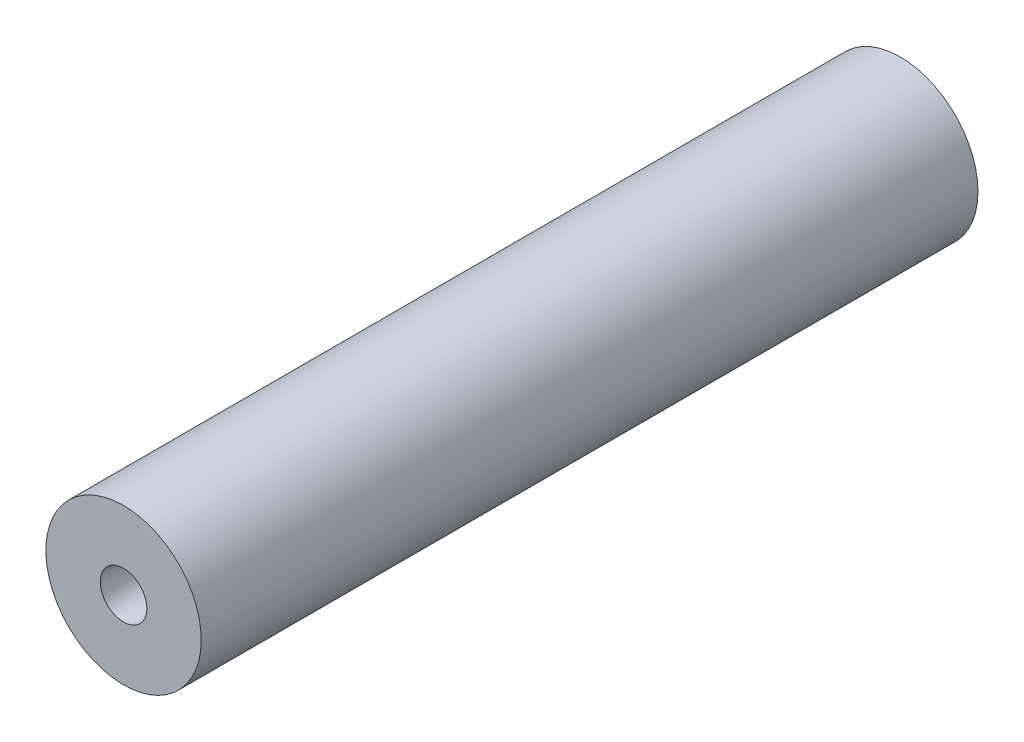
ISO-10303-21;
HEADER;
FILE_DESCRIPTION(('STEP AP214'),'2;1');
FILE_NAME('part.step','',(''),(''),'','','');
FILE_SCHEMA(('AUTOMOTIVE_DESIGN { 1 0 10303 214 1 1 1 1 }'));
ENDSEC;
DATA;
#1=APPLICATION_CONTEXT('core data for automotive mechanical design processes');
#2=APPLICATION_PROTOCOL_DEFINITION('international standard','automotive_design',2000,#1);
#3=PRODUCT_CONTEXT('',#1,'mechanical');
#4=PRODUCT('Part','Part','',(#3));
#5=PRODUCT_RELATED_PRODUCT_CATEGORY('part','',(#4));
#6=PRODUCT_DEFINITION_FORMATION('','',#4);
#7=PRODUCT_DEFINITION_CONTEXT('part definition',#1,'design');
#8=PRODUCT_DEFINITION('design','',#6,#7);
#9=PRODUCT_DEFINITION_SHAPE('','',#8);
#10=(LENGTH_UNIT() NAMED_UNIT(*) SI_UNIT(.MILLI.,.METRE.));
#11=(NAMED_UNIT(*) PLANE_ANGLE_UNIT() SI_UNIT($,.RADIAN.));
#12=(NAMED_UNIT(*) SI_UNIT($,.STERADIAN.) SOLID_ANGLE_UNIT());
#13=UNCERTAINTY_MEASURE_WITH_UNIT(LENGTH_MEASURE(1.E-05),#10,'distance_accuracy_value','');
#14=(GEOMETRIC_REPRESENTATION_CONTEXT(3) GLOBAL_UNCERTAINTY_ASSIGNED_CONTEXT((#13)) GLOBAL_UNIT_ASSIGNED_CONTEXT((#10,
#11,#12)) REPRESENTATION_CONTEXT('',''));
#15=CARTESIAN_POINT('',(0.,0.,0.));
#16=DIRECTION('',(0.,0.,1.));
#17=DIRECTION('',(1.,0.,0.));
#18=AXIS2_PLACEMENT_3D('',#15,#16,#17);
#19=CARTESIAN_POINT('',(0.,0.,100.));
#20=DIRECTION('',(0.,0.,1.));
#21=DIRECTION('',(1.,0.,0.));
#22=AXIS2_PLACEMENT_3D('',#19,#20,#21);
#23=PLANE('',#22);
#24=CARTESIAN_POINT('',(0.,0.,100.));
#25=DIRECTION('',(0.,0.,1.));
#26=DIRECTION('',(1.,0.,0.));
#27=AXIS2_PLACEMENT_3D('',#24,#25,#26);
#28=CIRCLE('',#27,10.);
#29=CARTESIAN_POINT('',(10.,0.,100.));
#30=VERTEX_POINT('',#29);
#31=EDGE_CURVE('E10',#30,#30,#28,.T.);
#32=ORIENTED_EDGE('',*,*,#31,.T.);
#33=EDGE_LOOP('',(#32));
#34=FACE_BOUND('',#33,.T.);
#35=CARTESIAN_POINT('',(0.,0.,100.));
#36=DIRECTION('',(0.,0.,1.));
#37=DIRECTION('',(1.,0.,0.));
#38=AXIS2_PLACEMENT_3D('',#35,#36,#37);
#39=CIRCLE('',#38,3.);
#40=CARTESIAN_POINT('',(3.,0.,100.));
#41=VERTEX_POINT('',#40);
#42=EDGE_CURVE('E56',#41,#41,#39,.T.);
#43=ORIENTED_EDGE('',*,*,#42,.F.);
#44=EDGE_LOOP('',(#43));
#45=FACE_BOUND('',#44,.T.);
#46=ADVANCED_FACE('F43',(#34,#45),#23,.T.);
#47=CARTESIAN_POINT('',(0.,0.,0.));
#48=DIRECTION('',(0.,0.,1.));
#49=DIRECTION('',(1.,0.,0.));
#50=AXIS2_PLACEMENT_3D('',#47,#48,#49);
#51=PLANE('',#50);
#52=CARTESIAN_POINT('',(0.,0.,0.));
#53=DIRECTION('',(0.,0.,1.));
#54=DIRECTION('',(1.,0.,0.));
#55=AXIS2_PLACEMENT_3D('',#52,#53,#54);
#56=CIRCLE('',#55,10.);
#57=CARTESIAN_POINT('',(10.,0.,0.));
#58=VERTEX_POINT('',#57);
#59=EDGE_CURVE('E47',#58,#58,#56,.T.);
#60=ORIENTED_EDGE('',*,*,#59,.F.);
#61=EDGE_LOOP('',(#60));
#62=FACE_BOUND('',#61,.T.);
#63=CARTESIAN_POINT('',(0.,0.,0.));
#64=DIRECTION('',(0.,0.,1.));
#65=DIRECTION('',(1.,0.,0.));
#66=AXIS2_PLACEMENT_3D('',#63,#64,#65);
#67=CIRCLE('',#66,3.);
#68=CARTESIAN_POINT('',(3.,0.,0.));
#69=VERTEX_POINT('',#68);
#70=EDGE_CURVE('E58',#69,#69,#67,.T.);
#71=ORIENTED_EDGE('',*,*,#70,.T.);
#72=EDGE_LOOP('',(#71));
#73=FACE_BOUND('',#72,.T.);
#74=ADVANCED_FACE('F70',(#62,#73),#51,.F.);
#75=CARTESIAN_POINT('',(0.,0.,100.));
#76=DIRECTION('',(0.,0.,-1.));
#77=DIRECTION('',(-1.,0.,0.));
#78=AXIS2_PLACEMENT_3D('',#75,#76,#77);
#79=CYLINDRICAL_SURFACE('',#78,10.);
#80=ORIENTED_EDGE('',*,*,#31,.F.);
#81=EDGE_LOOP('',(#80));
#82=FACE_BOUND('',#81,.T.);
#83=ORIENTED_EDGE('',*,*,#59,.T.);
#84=EDGE_LOOP('',(#83));
#85=FACE_BOUND('',#84,.T.);
#86=ADVANCED_FACE('F45',(#82,#85),#79,.T.);
#87=CARTESIAN_POINT('',(0.,0.,100.));
#88=DIRECTION('',(0.,0.,-1.));
#89=DIRECTION('',(-1.,0.,0.));
#90=AXIS2_PLACEMENT_3D('',#87,#88,#89);
#91=CYLINDRICAL_SURFACE('',#90,3.);
#92=ORIENTED_EDGE('',*,*,#42,.T.);
#93=EDGE_LOOP('',(#92));
#94=FACE_BOUND('',#93,.T.);
#95=ORIENTED_EDGE('',*,*,#70,.F.);
#96=EDGE_LOOP('',(#95));
#97=FACE_BOUND('',#96,.T.);
#98=ADVANCED_FACE('F66',(#94,#97),#91,.F.);
#99=CLOSED_SHELL('',(#46,#74,#86,#98));
#100=MANIFOLD_SOLID_BREP('B2',#99);
#101=ADVANCED_BREP_SHAPE_REPRESENTATION('',(#18,#100),#14);
#102=SHAPE_DEFINITION_REPRESENTATION(#9,#101);
ENDSEC;
END-ISO-10303-21;
